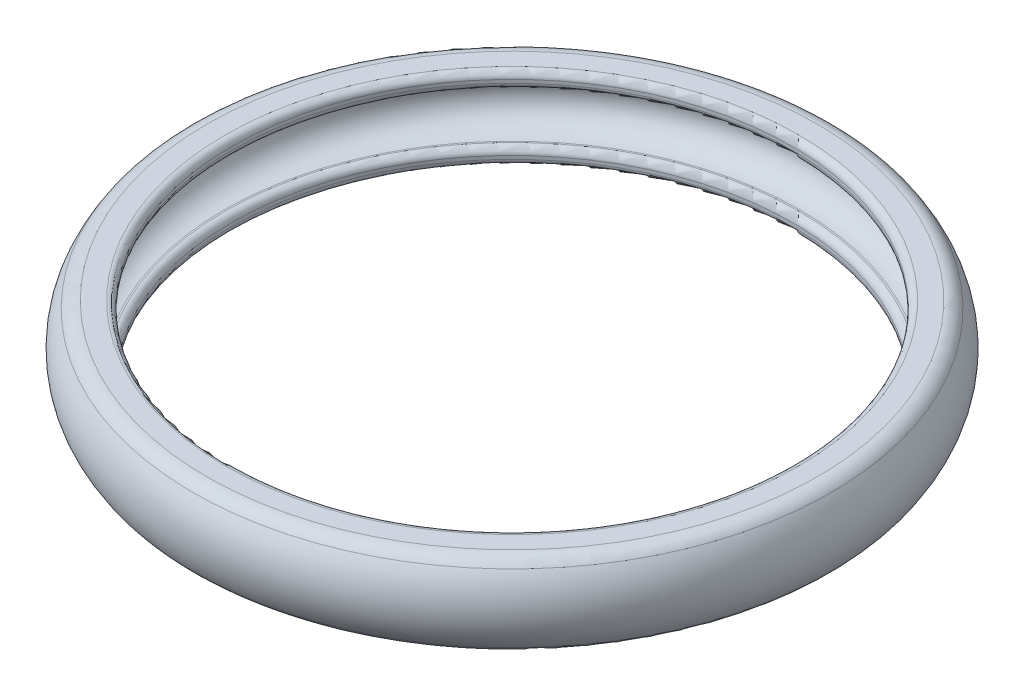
ISO-10303-21;
HEADER;
FILE_DESCRIPTION(('STEP AP214'),'2;1');
FILE_NAME('part.step','',(''),(''),'','','');
FILE_SCHEMA(('AUTOMOTIVE_DESIGN { 1 0 10303 214 1 1 1 1 }'));
ENDSEC;
DATA;
#1=APPLICATION_CONTEXT('core data for automotive mechanical design processes');
#2=APPLICATION_PROTOCOL_DEFINITION('international standard','automotive_design',2000,#1);
#3=PRODUCT_CONTEXT('',#1,'mechanical');
#4=PRODUCT('Part','Part','',(#3));
#5=PRODUCT_RELATED_PRODUCT_CATEGORY('part','',(#4));
#6=PRODUCT_DEFINITION_FORMATION('','',#4);
#7=PRODUCT_DEFINITION_CONTEXT('part definition',#1,'design');
#8=PRODUCT_DEFINITION('design','',#6,#7);
#9=PRODUCT_DEFINITION_SHAPE('','',#8);
#10=(LENGTH_UNIT() NAMED_UNIT(*) SI_UNIT(.MILLI.,.METRE.));
#11=(NAMED_UNIT(*) PLANE_ANGLE_UNIT() SI_UNIT($,.RADIAN.));
#12=(NAMED_UNIT(*) SI_UNIT($,.STERADIAN.) SOLID_ANGLE_UNIT());
#13=UNCERTAINTY_MEASURE_WITH_UNIT(LENGTH_MEASURE(1.E-05),#10,'distance_accuracy_value','');
#14=(GEOMETRIC_REPRESENTATION_CONTEXT(3) GLOBAL_UNCERTAINTY_ASSIGNED_CONTEXT((#13)) GLOBAL_UNIT_ASSIGNED_CONTEXT((#10,
#11,#12)) REPRESENTATION_CONTEXT('',''));
#15=CARTESIAN_POINT('',(0.,0.,0.));
#16=DIRECTION('',(0.,0.,1.));
#17=DIRECTION('',(1.,0.,0.));
#18=AXIS2_PLACEMENT_3D('',#15,#16,#17);
#19=CARTESIAN_POINT('',(0.,0.399999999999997,0.));
#20=DIRECTION('',(0.,1.,0.));
#21=DIRECTION('',(-1.,0.,0.));
#22=AXIS2_PLACEMENT_3D('',#19,#20,#21);
#23=TOROIDAL_SURFACE('',#22,17.4,0.400000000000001);
#24=CARTESIAN_POINT('',(0.,0.,0.));
#25=DIRECTION('',(0.,1.,0.));
#26=DIRECTION('',(-1.,0.,0.));
#27=AXIS2_PLACEMENT_3D('',#24,#25,#26);
#28=CIRCLE('',#27,17.4);
#29=CARTESIAN_POINT('',(-17.4,0.,0.));
#30=VERTEX_POINT('',#29);
#31=EDGE_CURVE('E79',#30,#30,#28,.T.);
#32=ORIENTED_EDGE('',*,*,#31,.F.);
#33=EDGE_LOOP('',(#32));
#34=FACE_BOUND('',#33,.T.);
#35=CARTESIAN_POINT('',(0.,0.400000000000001,0.));
#36=DIRECTION('',(0.,1.,0.));
#37=DIRECTION('',(-1.,0.,0.));
#38=AXIS2_PLACEMENT_3D('',#35,#36,#37);
#39=CIRCLE('',#38,17.);
#40=CARTESIAN_POINT('',(-17.,0.399999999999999,0.));
#41=VERTEX_POINT('',#40);
#42=EDGE_CURVE('E10',#41,#41,#39,.T.);
#43=ORIENTED_EDGE('',*,*,#42,.T.);
#44=EDGE_LOOP('',(#43));
#45=FACE_BOUND('',#44,.T.);
#46=ADVANCED_FACE('F33',(#34,#45),#23,.T.);
#47=CARTESIAN_POINT('',(0.,18.5238095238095,0.));
#48=DIRECTION('',(0.,1.,0.));
#49=DIRECTION('',(-1.,0.,0.));
#50=AXIS2_PLACEMENT_3D('',#47,#48,#49);
#51=CYLINDRICAL_SURFACE('',#50,17.);
#52=ORIENTED_EDGE('',*,*,#42,.F.);
#53=EDGE_LOOP('',(#52));
#54=FACE_BOUND('',#53,.T.);
#55=CARTESIAN_POINT('',(0.,0.599999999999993,0.));
#56=DIRECTION('',(0.,1.,0.));
#57=DIRECTION('',(-1.,0.,0.));
#58=AXIS2_PLACEMENT_3D('',#55,#56,#57);
#59=CIRCLE('',#58,17.);
#60=CARTESIAN_POINT('',(-17.,0.599999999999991,0.));
#61=VERTEX_POINT('',#60);
#62=EDGE_CURVE('E39',#61,#61,#59,.T.);
#63=ORIENTED_EDGE('',*,*,#62,.T.);
#64=EDGE_LOOP('',(#63));
#65=FACE_BOUND('',#64,.T.);
#66=ADVANCED_FACE('F86',(#54,#65),#51,.F.);
#67=CARTESIAN_POINT('',(0.,0.599999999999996,0.));
#68=DIRECTION('',(0.,1.,0.));
#69=DIRECTION('',(-1.,0.,0.));
#70=AXIS2_PLACEMENT_3D('',#67,#68,#69);
#71=TOROIDAL_SURFACE('',#70,17.4,0.400000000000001);
#72=ORIENTED_EDGE('',*,*,#62,.F.);
#73=EDGE_LOOP('',(#72));
#74=FACE_BOUND('',#73,.T.);
#75=CARTESIAN_POINT('',(0.,0.999999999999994,0.));
#76=DIRECTION('',(0.,1.,0.));
#77=DIRECTION('',(-1.,0.,0.));
#78=AXIS2_PLACEMENT_3D('',#75,#76,#77);
#79=CIRCLE('',#78,17.4);
#80=CARTESIAN_POINT('',(-17.4,0.999999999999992,0.));
#81=VERTEX_POINT('',#80);
#82=EDGE_CURVE('E43',#81,#81,#79,.T.);
#83=ORIENTED_EDGE('',*,*,#82,.T.);
#84=EDGE_LOOP('',(#83));
#85=FACE_BOUND('',#84,.T.);
#86=ADVANCED_FACE('F90',(#74,#85),#71,.T.);
#87=CARTESIAN_POINT('',(17.4,0.999999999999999,0.));
#88=DIRECTION('',(0.,-1.,0.));
#89=DIRECTION('',(1.,0.,0.));
#90=AXIS2_PLACEMENT_3D('',#87,#88,#89);
#91=PLANE('',#90);
#92=ORIENTED_EDGE('',*,*,#82,.F.);
#93=EDGE_LOOP('',(#92));
#94=FACE_BOUND('',#93,.T.);
#95=CARTESIAN_POINT('',(0.,0.999999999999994,0.));
#96=DIRECTION('',(0.,1.,0.));
#97=DIRECTION('',(-1.,0.,0.));
#98=AXIS2_PLACEMENT_3D('',#95,#96,#97);
#99=CIRCLE('',#98,17.5);
#100=CARTESIAN_POINT('',(-17.5,0.999999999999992,0.));
#101=VERTEX_POINT('',#100);
#102=EDGE_CURVE('E47',#101,#101,#99,.T.);
#103=ORIENTED_EDGE('',*,*,#102,.T.);
#104=EDGE_LOOP('',(#103));
#105=FACE_BOUND('',#104,.T.);
#106=ADVANCED_FACE('F95',(#94,#105),#91,.F.);
#107=CARTESIAN_POINT('',(0.,2.5,0.));
#108=DIRECTION('',(0.,1.,0.));
#109=DIRECTION('',(-1.,0.,0.));
#110=AXIS2_PLACEMENT_3D('',#107,#108,#109);
#111=TOROIDAL_SURFACE('',#110,17.5,1.5);
#112=ORIENTED_EDGE('',*,*,#102,.F.);
#113=EDGE_LOOP('',(#112));
#114=FACE_BOUND('',#113,.T.);
#115=CARTESIAN_POINT('',(0.,4.,0.));
#116=DIRECTION('',(0.,1.,0.));
#117=DIRECTION('',(-1.,0.,0.));
#118=AXIS2_PLACEMENT_3D('',#115,#116,#117);
#119=CIRCLE('',#118,17.5);
#120=CARTESIAN_POINT('',(-17.5,4.,0.));
#121=VERTEX_POINT('',#120);
#122=EDGE_CURVE('E52',#121,#121,#119,.T.);
#123=ORIENTED_EDGE('',*,*,#122,.T.);
#124=EDGE_LOOP('',(#123));
#125=FACE_BOUND('',#124,.T.);
#126=ADVANCED_FACE('F101',(#114,#125),#111,.F.);
#127=CARTESIAN_POINT('',(17.4,4.,0.));
#128=DIRECTION('',(0.,1.,0.));
#129=DIRECTION('',(-1.,0.,0.));
#130=AXIS2_PLACEMENT_3D('',#127,#128,#129);
#131=PLANE('',#130);
#132=ORIENTED_EDGE('',*,*,#122,.F.);
#133=EDGE_LOOP('',(#132));
#134=FACE_BOUND('',#133,.T.);
#135=CARTESIAN_POINT('',(0.,4.,0.));
#136=DIRECTION('',(0.,1.,0.));
#137=DIRECTION('',(-1.,0.,0.));
#138=AXIS2_PLACEMENT_3D('',#135,#136,#137);
#139=CIRCLE('',#138,17.4);
#140=CARTESIAN_POINT('',(-17.4,4.,0.));
#141=VERTEX_POINT('',#140);
#142=EDGE_CURVE('E55',#141,#141,#139,.T.);
#143=ORIENTED_EDGE('',*,*,#142,.T.);
#144=EDGE_LOOP('',(#143));
#145=FACE_BOUND('',#144,.T.);
#146=ADVANCED_FACE('F105',(#134,#145),#131,.F.);
#147=CARTESIAN_POINT('',(0.,4.4,0.));
#148=DIRECTION('',(0.,1.,0.));
#149=DIRECTION('',(-1.,0.,0.));
#150=AXIS2_PLACEMENT_3D('',#147,#148,#149);
#151=TOROIDAL_SURFACE('',#150,17.4,0.400000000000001);
#152=ORIENTED_EDGE('',*,*,#142,.F.);
#153=EDGE_LOOP('',(#152));
#154=FACE_BOUND('',#153,.T.);
#155=CARTESIAN_POINT('',(0.,4.4,0.));
#156=DIRECTION('',(0.,1.,0.));
#157=DIRECTION('',(-1.,0.,0.));
#158=AXIS2_PLACEMENT_3D('',#155,#156,#157);
#159=CIRCLE('',#158,17.);
#160=CARTESIAN_POINT('',(-17.,4.4,0.));
#161=VERTEX_POINT('',#160);
#162=EDGE_CURVE('E58',#161,#161,#159,.T.);
#163=ORIENTED_EDGE('',*,*,#162,.T.);
#164=EDGE_LOOP('',(#163));
#165=FACE_BOUND('',#164,.T.);
#166=ADVANCED_FACE('F109',(#154,#165),#151,.T.);
#167=CARTESIAN_POINT('',(0.,18.5238095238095,0.));
#168=DIRECTION('',(0.,1.,0.));
#169=DIRECTION('',(-1.,0.,0.));
#170=AXIS2_PLACEMENT_3D('',#167,#168,#169);
#171=CYLINDRICAL_SURFACE('',#170,17.);
#172=ORIENTED_EDGE('',*,*,#162,.F.);
#173=EDGE_LOOP('',(#172));
#174=FACE_BOUND('',#173,.T.);
#175=CARTESIAN_POINT('',(0.,4.59999999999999,0.));
#176=DIRECTION('',(0.,1.,0.));
#177=DIRECTION('',(-1.,0.,0.));
#178=AXIS2_PLACEMENT_3D('',#175,#176,#177);
#179=CIRCLE('',#178,17.);
#180=CARTESIAN_POINT('',(-17.,4.59999999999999,0.));
#181=VERTEX_POINT('',#180);
#182=EDGE_CURVE('E61',#181,#181,#179,.T.);
#183=ORIENTED_EDGE('',*,*,#182,.T.);
#184=EDGE_LOOP('',(#183));
#185=FACE_BOUND('',#184,.T.);
#186=ADVANCED_FACE('F113',(#174,#185),#171,.F.);
#187=CARTESIAN_POINT('',(0.,4.6,0.));
#188=DIRECTION('',(0.,1.,0.));
#189=DIRECTION('',(-1.,0.,0.));
#190=AXIS2_PLACEMENT_3D('',#187,#188,#189);
#191=TOROIDAL_SURFACE('',#190,17.4,0.400000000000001);
#192=ORIENTED_EDGE('',*,*,#182,.F.);
#193=EDGE_LOOP('',(#192));
#194=FACE_BOUND('',#193,.T.);
#195=CARTESIAN_POINT('',(0.,5.,0.));
#196=DIRECTION('',(0.,1.,0.));
#197=DIRECTION('',(-1.,0.,0.));
#198=AXIS2_PLACEMENT_3D('',#195,#196,#197);
#199=CIRCLE('',#198,17.4);
#200=CARTESIAN_POINT('',(-17.4,4.99999999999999,0.));
#201=VERTEX_POINT('',#200);
#202=EDGE_CURVE('E64',#201,#201,#199,.T.);
#203=ORIENTED_EDGE('',*,*,#202,.T.);
#204=EDGE_LOOP('',(#203));
#205=FACE_BOUND('',#204,.T.);
#206=ADVANCED_FACE('F117',(#194,#205),#191,.T.);
#207=CARTESIAN_POINT('',(17.4,5.,0.));
#208=DIRECTION('',(0.,-1.,0.));
#209=DIRECTION('',(1.,0.,0.));
#210=AXIS2_PLACEMENT_3D('',#207,#208,#209);
#211=PLANE('',#210);
#212=ORIENTED_EDGE('',*,*,#202,.F.);
#213=EDGE_LOOP('',(#212));
#214=FACE_BOUND('',#213,.T.);
#215=CARTESIAN_POINT('',(0.,5.,0.));
#216=DIRECTION('',(0.,1.,0.));
#217=DIRECTION('',(-1.,0.,0.));
#218=AXIS2_PLACEMENT_3D('',#215,#216,#217);
#219=CIRCLE('',#218,18.5292109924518);
#220=CARTESIAN_POINT('',(-18.5292109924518,4.99999999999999,0.));
#221=VERTEX_POINT('',#220);
#222=EDGE_CURVE('E67',#221,#221,#219,.T.);
#223=ORIENTED_EDGE('',*,*,#222,.T.);
#224=EDGE_LOOP('',(#223));
#225=FACE_BOUND('',#224,.T.);
#226=ADVANCED_FACE('F121',(#214,#225),#211,.F.);
#227=CARTESIAN_POINT('',(0.,4.,0.));
#228=DIRECTION('',(0.,1.,0.));
#229=DIRECTION('',(-1.,0.,0.));
#230=AXIS2_PLACEMENT_3D('',#227,#228,#229);
#231=TOROIDAL_SURFACE('',#230,18.5292109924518,1.);
#232=ORIENTED_EDGE('',*,*,#222,.F.);
#233=EDGE_LOOP('',(#232));
#234=FACE_BOUND('',#233,.T.);
#235=CARTESIAN_POINT('',(0.,4.57142857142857,0.));
#236=DIRECTION('',(0.,1.,0.));
#237=DIRECTION('',(-1.,0.,0.));
#238=AXIS2_PLACEMENT_3D('',#235,#236,#237);
#239=CIRCLE('',#238,19.3498627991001);
#240=CARTESIAN_POINT('',(-19.3498627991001,4.57142857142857,0.));
#241=VERTEX_POINT('',#240);
#242=EDGE_CURVE('E70',#241,#241,#239,.T.);
#243=ORIENTED_EDGE('',*,*,#242,.T.);
#244=EDGE_LOOP('',(#243));
#245=FACE_BOUND('',#244,.T.);
#246=ADVANCED_FACE('F125',(#234,#245),#231,.T.);
#247=CARTESIAN_POINT('',(0.,2.5,0.));
#248=DIRECTION('',(0.,1.,0.));
#249=DIRECTION('',(-1.,0.,0.));
#250=AXIS2_PLACEMENT_3D('',#247,#248,#249);
#251=TOROIDAL_SURFACE('',#250,16.375,3.625);
#252=ORIENTED_EDGE('',*,*,#242,.F.);
#253=EDGE_LOOP('',(#252));
#254=FACE_BOUND('',#253,.T.);
#255=CARTESIAN_POINT('',(0.,0.428571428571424,0.));
#256=DIRECTION('',(0.,1.,0.));
#257=DIRECTION('',(-1.,0.,0.));
#258=AXIS2_PLACEMENT_3D('',#255,#256,#257);
#259=CIRCLE('',#258,19.3498627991);
#260=CARTESIAN_POINT('',(-19.3498627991,0.428571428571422,0.));
#261=VERTEX_POINT('',#260);
#262=EDGE_CURVE('E73',#261,#261,#259,.T.);
#263=ORIENTED_EDGE('',*,*,#262,.T.);
#264=EDGE_LOOP('',(#263));
#265=FACE_BOUND('',#264,.T.);
#266=ADVANCED_FACE('F129',(#254,#265),#251,.T.);
#267=CARTESIAN_POINT('',(0.,0.999999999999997,0.));
#268=DIRECTION('',(0.,1.,0.));
#269=DIRECTION('',(-1.,0.,0.));
#270=AXIS2_PLACEMENT_3D('',#267,#268,#269);
#271=TOROIDAL_SURFACE('',#270,18.5292109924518,1.);
#272=ORIENTED_EDGE('',*,*,#262,.F.);
#273=EDGE_LOOP('',(#272));
#274=FACE_BOUND('',#273,.T.);
#275=CARTESIAN_POINT('',(0.,0.,0.));
#276=DIRECTION('',(0.,1.,0.));
#277=DIRECTION('',(-1.,0.,0.));
#278=AXIS2_PLACEMENT_3D('',#275,#276,#277);
#279=CIRCLE('',#278,18.5292109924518);
#280=CARTESIAN_POINT('',(-18.5292109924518,0.,0.));
#281=VERTEX_POINT('',#280);
#282=EDGE_CURVE('E76',#281,#281,#279,.T.);
#283=ORIENTED_EDGE('',*,*,#282,.T.);
#284=EDGE_LOOP('',(#283));
#285=FACE_BOUND('',#284,.T.);
#286=ADVANCED_FACE('F133',(#274,#285),#271,.T.);
#287=CARTESIAN_POINT('',(17.4,0.,0.));
#288=DIRECTION('',(0.,1.,0.));
#289=DIRECTION('',(-1.,0.,0.));
#290=AXIS2_PLACEMENT_3D('',#287,#288,#289);
#291=PLANE('',#290);
#292=ORIENTED_EDGE('',*,*,#282,.F.);
#293=EDGE_LOOP('',(#292));
#294=FACE_BOUND('',#293,.T.);
#295=ORIENTED_EDGE('',*,*,#31,.T.);
#296=EDGE_LOOP('',(#295));
#297=FACE_BOUND('',#296,.T.);
#298=ADVANCED_FACE('F83',(#294,#297),#291,.F.);
#299=CLOSED_SHELL('',(#46,#66,#86,#106,#126,#146,#166,#186,#206,#226,#246,#266,#286,#298));
#300=MANIFOLD_SOLID_BREP('B2',#299);
#301=ADVANCED_BREP_SHAPE_REPRESENTATION('',(#18,#300),#14);
#302=SHAPE_DEFINITION_REPRESENTATION(#9,#301);
ENDSEC;
END-ISO-10303-21;
